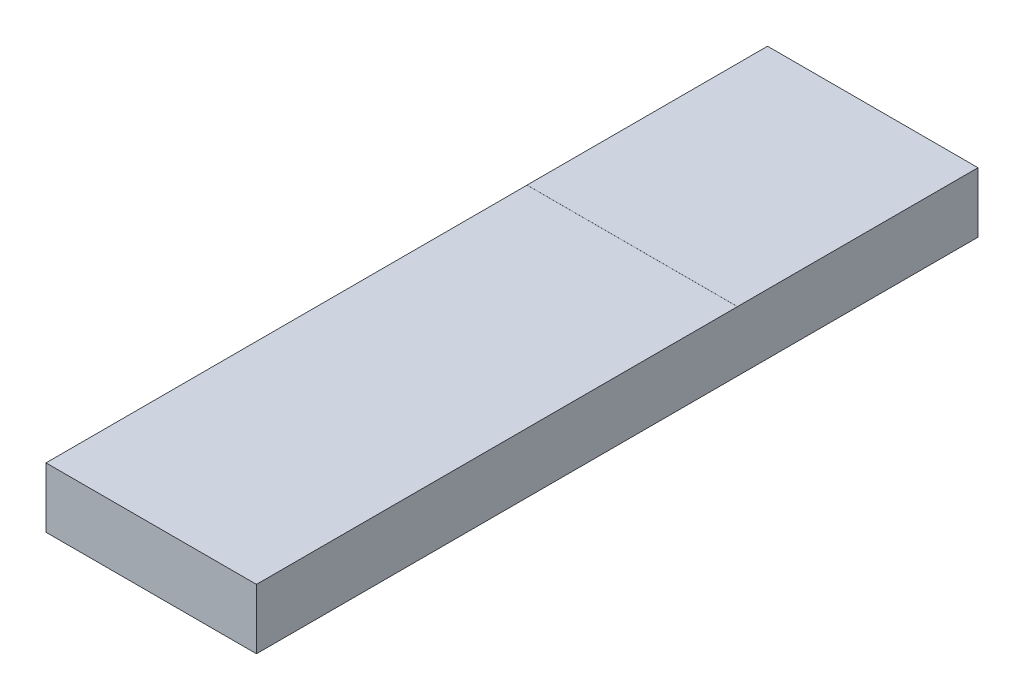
from build123d import *

# Parameters (mm, degrees)
ESQUISSE1_W        = 350
ESQUISSE1_H        = 100
BOSS_EXTRU_1_DEPTH = 1200
ESQUISSE2_W        = 350
ESQUISSE2_H        = 400
BOSS_EXTRU_2_DEPTH = 0.1


with BuildPart() as part:
    # Esquisse1 → Boss.-Extru.1 (new body)
    with BuildSketch(Plane.XY):
        with Locations((175, 50)):
            Rectangle(ESQUISSE1_W, ESQUISSE1_H)
    extrude(amount=BOSS_EXTRU_1_DEPTH)

    # Esquisse2 → Boss.-Extru.2 (add)
    with BuildSketch(Plane(origin=(0, 100, 0), x_dir=(1, 0, 0), z_dir=(0, 1, 0))):
        with Locations((175, -200)):
            Rectangle(ESQUISSE2_W, ESQUISSE2_H)
    extrude(amount=BOSS_EXTRU_2_DEPTH)


solid = part.part
